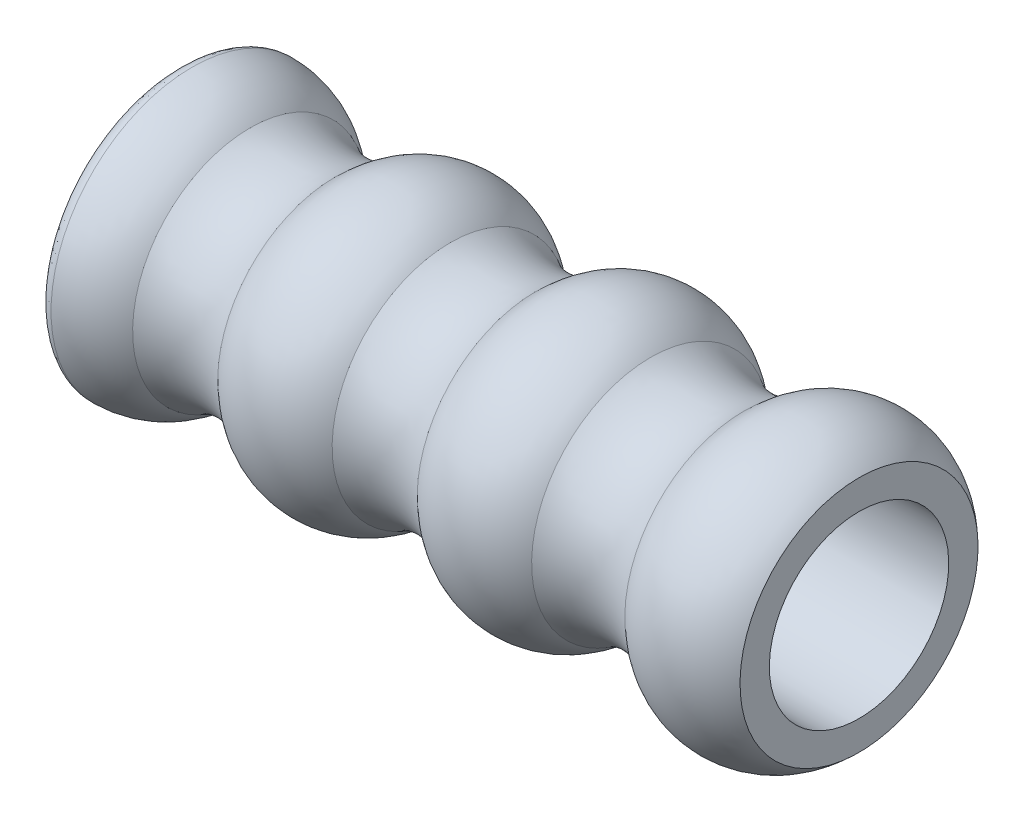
from build123d import *

# Parameters (mm, degrees)
ESQUISSE3_R             = 14
ENL_V_MAT_EXTRU_1_DEPTH = 121.44344452


with BuildPart() as part:
    # Esquisse2 → R_volution2 (revolve)
    with BuildSketch(Plane.XY):
        with BuildLine():
            Line((-4.148545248, -21.176409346), (106.004684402, -21.176409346))
            Line((106.004684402, -21.176409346), (106.004684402, -2.600891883))
            ThreePointArc((106.004684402, -2.600891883), (97.010799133, 1.012413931), (88.016913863, -2.600891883))
            ThreePointArc((88.016913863, -2.600891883), (80.745850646, -4.824452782), (73.474787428, -2.600891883))
            ThreePointArc((73.474787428, -2.600891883), (64.455536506, 0.949458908), (55.486983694, -2.727080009))
            ThreePointArc((55.486983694, -2.727080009), (48.847870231, -4.550221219), (42.208756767, -2.727080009))
            ThreePointArc((42.208756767, -2.727080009), (33.189505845, 0.823270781), (24.220953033, -2.853268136))
            ThreePointArc((24.220953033, -2.853268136), (17.581839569, -4.676409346), (10.942726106, -2.853268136))
            ThreePointArc((10.942726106, -2.853268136), (6.771697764, -0.130645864), (1.882977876, 0.823590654))
            add(Edge.make_bspline(
                [(1.882977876, 0.823590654), (-4.159058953, 0.823590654), (-4.148545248, -21.176409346)],
                knots=[3.141592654, 3.141592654, 3.141592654, 4.714129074, 4.714129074, 4.714129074], degree=2, weights=[1, 0.706491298, 1]))
        make_face()
    revolve(axis=Axis((103.092609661, -21.176409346, 0), (-1, 0, 0)))

    # Esquisse3 → Enl_v. mat.-Extru.1 (cut, through all)
    with BuildSketch(Plane(origin=(106.004684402, 0, 0), x_dir=(0, 0, -1), z_dir=(1, 0, 0))):
        with Locations(Location((0, -21.176409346, 0), (0, 0, 90))):
            Circle(ESQUISSE3_R)
    extrude(amount=-ENL_V_MAT_EXTRU_1_DEPTH, mode=Mode.SUBTRACT)


solid = part.part
